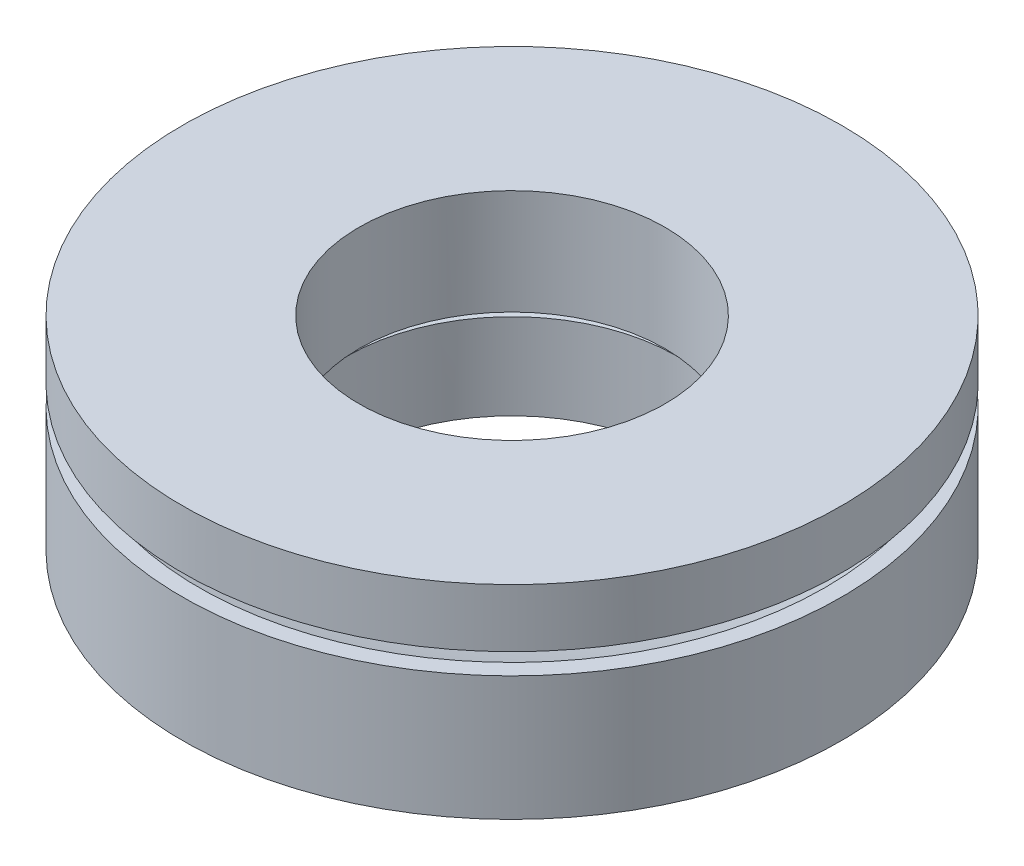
from build123d import *


with BuildPart() as part:
    # Sketch1 → Revolve1 (revolve)
    with BuildSketch(Plane.XY, mode=Mode.PRIVATE) as revolve1_sk:
        with BuildLine():
            Line((-11.1125, 6.858), (-11.1125, 4.898571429))
            ThreePointArc((-11.1125, 4.898571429), (-8.174501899, 3.960739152), (-5.159375, 3.312378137))
            Line((-5.159375, 3.312378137), (-5.159375, 6.858))
            Line((-5.159375, 6.858), (-11.1125, 6.858))
        make_face()
        with BuildLine():
            Line((-11.1125, 4.192211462), (-11.1125, 0))
            Line((-11.1125, 0), (-5.55625, 0))
            Line((-5.55625, 0), (-5.55625, 2.896614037))
            ThreePointArc((-5.55625, 2.896614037), (-8.082564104, 3.444054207), (-10.556875, 4.192211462))
            Line((-10.556875, 4.192211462), (-11.1125, 4.192211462))
        make_face()
    revolve(revolve1_sk.sketch.rotate(Axis((0, 0, 0), (0, 1, 0)), 270), axis=Axis((0, 0, 0), (0, 1, 0)))


solid = part.part
